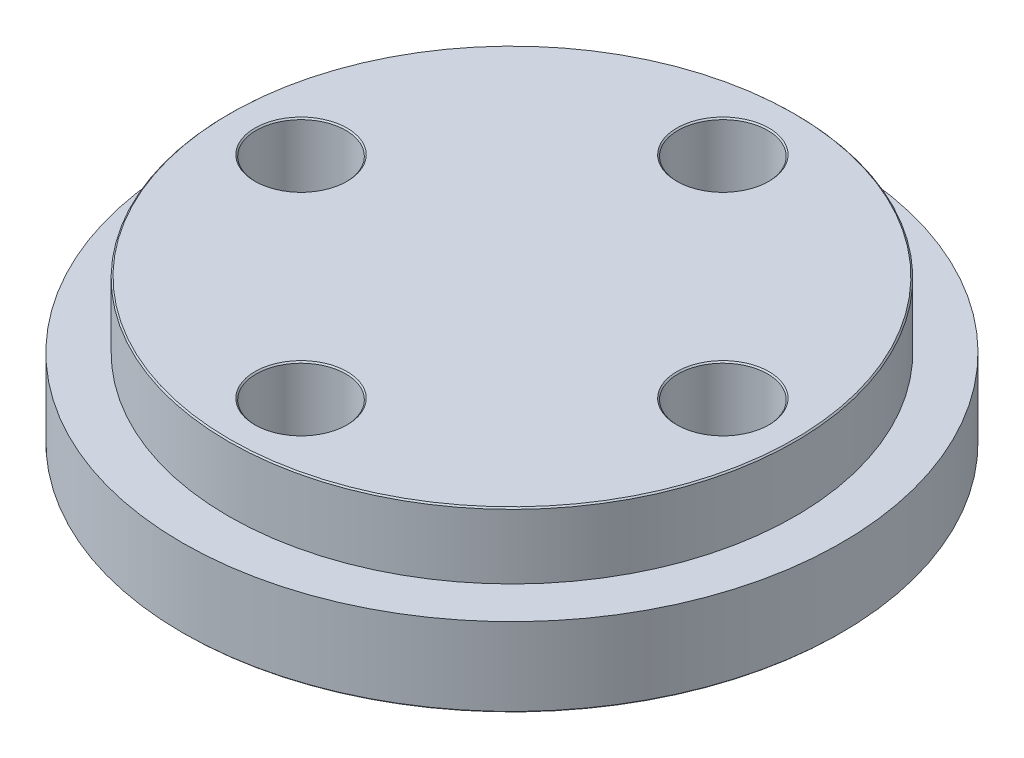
ISO-10303-21;
HEADER;
FILE_DESCRIPTION(('STEP AP214'),'2;1');
FILE_NAME('part.step','',(''),(''),'','','');
FILE_SCHEMA(('AUTOMOTIVE_DESIGN { 1 0 10303 214 1 1 1 1 }'));
ENDSEC;
DATA;
#1=APPLICATION_CONTEXT('core data for automotive mechanical design processes');
#2=APPLICATION_PROTOCOL_DEFINITION('international standard','automotive_design',2000,#1);
#3=PRODUCT_CONTEXT('',#1,'mechanical');
#4=PRODUCT('Part','Part','',(#3));
#5=PRODUCT_RELATED_PRODUCT_CATEGORY('part','',(#4));
#6=PRODUCT_DEFINITION_FORMATION('','',#4);
#7=PRODUCT_DEFINITION_CONTEXT('part definition',#1,'design');
#8=PRODUCT_DEFINITION('design','',#6,#7);
#9=PRODUCT_DEFINITION_SHAPE('','',#8);
#10=(LENGTH_UNIT() NAMED_UNIT(*) SI_UNIT(.MILLI.,.METRE.));
#11=(NAMED_UNIT(*) PLANE_ANGLE_UNIT() SI_UNIT($,.RADIAN.));
#12=(NAMED_UNIT(*) SI_UNIT($,.STERADIAN.) SOLID_ANGLE_UNIT());
#13=UNCERTAINTY_MEASURE_WITH_UNIT(LENGTH_MEASURE(1.E-05),#10,'distance_accuracy_value','');
#14=(GEOMETRIC_REPRESENTATION_CONTEXT(3) GLOBAL_UNCERTAINTY_ASSIGNED_CONTEXT((#13)) GLOBAL_UNIT_ASSIGNED_CONTEXT((#10,
#11,#12)) REPRESENTATION_CONTEXT('',''));
#15=CARTESIAN_POINT('',(0.,0.,0.));
#16=DIRECTION('',(0.,0.,1.));
#17=DIRECTION('',(1.,0.,0.));
#18=AXIS2_PLACEMENT_3D('',#15,#16,#17);
#19=CARTESIAN_POINT('',(0.,6.,0.));
#20=DIRECTION('',(0.,-1.,0.));
#21=DIRECTION('',(0.,0.,-1.));
#22=AXIS2_PLACEMENT_3D('',#19,#20,#21);
#23=CYLINDRICAL_SURFACE('',#22,25.);
#24=CARTESIAN_POINT('',(0.,0.0999999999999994,0.));
#25=DIRECTION('',(0.,1.,0.));
#26=DIRECTION('',(0.,0.,1.));
#27=AXIS2_PLACEMENT_3D('',#24,#25,#26);
#28=CIRCLE('',#27,25.);
#29=CARTESIAN_POINT('',(0.,0.0999999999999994,25.));
#30=VERTEX_POINT('',#29);
#31=EDGE_CURVE('E59',#30,#30,#28,.T.);
#32=ORIENTED_EDGE('',*,*,#31,.T.);
#33=EDGE_LOOP('',(#32));
#34=FACE_BOUND('',#33,.T.);
#35=CARTESIAN_POINT('',(0.,6.,0.));
#36=DIRECTION('',(0.,1.,0.));
#37=DIRECTION('',(0.,0.,1.));
#38=AXIS2_PLACEMENT_3D('',#35,#36,#37);
#39=CIRCLE('',#38,25.);
#40=CARTESIAN_POINT('',(0.,6.,25.));
#41=VERTEX_POINT('',#40);
#42=EDGE_CURVE('E104',#41,#41,#39,.T.);
#43=ORIENTED_EDGE('',*,*,#42,.F.);
#44=EDGE_LOOP('',(#43));
#45=FACE_BOUND('',#44,.T.);
#46=ADVANCED_FACE('F36',(#34,#45),#23,.T.);
#47=CARTESIAN_POINT('',(0.,6.,0.));
#48=DIRECTION('',(0.,1.,0.));
#49=DIRECTION('',(0.,0.,1.));
#50=AXIS2_PLACEMENT_3D('',#47,#48,#49);
#51=PLANE('',#50);
#52=CARTESIAN_POINT('',(0.,6.,0.));
#53=DIRECTION('',(0.,1.,0.));
#54=DIRECTION('',(0.,0.,1.));
#55=AXIS2_PLACEMENT_3D('',#52,#53,#54);
#56=CIRCLE('',#55,21.5);
#57=CARTESIAN_POINT('',(0.,6.,21.5));
#58=VERTEX_POINT('',#57);
#59=EDGE_CURVE('E107',#58,#58,#56,.T.);
#60=ORIENTED_EDGE('',*,*,#59,.F.);
#61=EDGE_LOOP('',(#60));
#62=FACE_BOUND('',#61,.T.);
#63=ORIENTED_EDGE('',*,*,#42,.T.);
#64=EDGE_LOOP('',(#63));
#65=FACE_BOUND('',#64,.T.);
#66=ADVANCED_FACE('F113',(#62,#65),#51,.T.);
#67=CARTESIAN_POINT('',(0.,0.,0.));
#68=DIRECTION('',(0.,1.,0.));
#69=DIRECTION('',(0.,0.,1.));
#70=AXIS2_PLACEMENT_3D('',#67,#68,#69);
#71=PLANE('',#70);
#72=CARTESIAN_POINT('',(0.,0.,0.));
#73=DIRECTION('',(0.,1.,0.));
#74=DIRECTION('',(0.,0.,1.));
#75=AXIS2_PLACEMENT_3D('',#72,#73,#74);
#76=CIRCLE('',#75,24.9);
#77=CARTESIAN_POINT('',(0.,0.,24.9));
#78=VERTEX_POINT('',#77);
#79=EDGE_CURVE('E10',#78,#78,#76,.F.);
#80=ORIENTED_EDGE('',*,*,#79,.T.);
#81=EDGE_LOOP('',(#80));
#82=FACE_BOUND('',#81,.T.);
#83=CARTESIAN_POINT('',(0.,0.,16.));
#84=DIRECTION('',(0.,1.,0.));
#85=DIRECTION('',(0.,0.,1.));
#86=AXIS2_PLACEMENT_3D('',#83,#84,#85);
#87=CIRCLE('',#86,3.49999999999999);
#88=CARTESIAN_POINT('',(0.,0.,19.5));
#89=VERTEX_POINT('',#88);
#90=EDGE_CURVE('E43',#89,#89,#87,.T.);
#91=ORIENTED_EDGE('',*,*,#90,.T.);
#92=EDGE_LOOP('',(#91));
#93=FACE_BOUND('',#92,.T.);
#94=CARTESIAN_POINT('',(-16.,0.,0.));
#95=DIRECTION('',(0.,1.,0.));
#96=DIRECTION('',(0.,0.,1.));
#97=AXIS2_PLACEMENT_3D('',#94,#95,#96);
#98=CIRCLE('',#97,3.49999999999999);
#99=CARTESIAN_POINT('',(-16.,0.,3.49999999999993));
#100=VERTEX_POINT('',#99);
#101=EDGE_CURVE('E47',#100,#100,#98,.T.);
#102=ORIENTED_EDGE('',*,*,#101,.T.);
#103=EDGE_LOOP('',(#102));
#104=FACE_BOUND('',#103,.T.);
#105=CARTESIAN_POINT('',(0.,0.,-16.));
#106=DIRECTION('',(0.,1.,0.));
#107=DIRECTION('',(0.,0.,1.));
#108=AXIS2_PLACEMENT_3D('',#105,#106,#107);
#109=CIRCLE('',#108,3.49999999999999);
#110=CARTESIAN_POINT('',(0.,0.,-12.5));
#111=VERTEX_POINT('',#110);
#112=EDGE_CURVE('E51',#111,#111,#109,.T.);
#113=ORIENTED_EDGE('',*,*,#112,.T.);
#114=EDGE_LOOP('',(#113));
#115=FACE_BOUND('',#114,.T.);
#116=CARTESIAN_POINT('',(16.,0.,1.6759110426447E-13));
#117=DIRECTION('',(0.,1.,0.));
#118=DIRECTION('',(0.,0.,1.));
#119=AXIS2_PLACEMENT_3D('',#116,#117,#118);
#120=CIRCLE('',#119,3.49999999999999);
#121=CARTESIAN_POINT('',(16.,0.,3.50000000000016));
#122=VERTEX_POINT('',#121);
#123=EDGE_CURVE('E56',#122,#122,#120,.T.);
#124=ORIENTED_EDGE('',*,*,#123,.T.);
#125=EDGE_LOOP('',(#124));
#126=FACE_BOUND('',#125,.T.);
#127=ADVANCED_FACE('F116',(#82,#93,#104,#115,#126),#71,.F.);
#128=CARTESIAN_POINT('',(0.,11.,0.));
#129=DIRECTION('',(0.,-1.,0.));
#130=DIRECTION('',(0.,0.,-1.));
#131=AXIS2_PLACEMENT_3D('',#128,#129,#130);
#132=CYLINDRICAL_SURFACE('',#131,21.5);
#133=CARTESIAN_POINT('',(0.,10.9,0.));
#134=DIRECTION('',(0.,1.,0.));
#135=DIRECTION('',(0.,0.,1.));
#136=AXIS2_PLACEMENT_3D('',#133,#134,#135);
#137=CIRCLE('',#136,21.5);
#138=CARTESIAN_POINT('',(0.,10.9,21.5));
#139=VERTEX_POINT('',#138);
#140=EDGE_CURVE('E86',#139,#139,#137,.F.);
#141=ORIENTED_EDGE('',*,*,#140,.T.);
#142=EDGE_LOOP('',(#141));
#143=FACE_BOUND('',#142,.T.);
#144=ORIENTED_EDGE('',*,*,#59,.T.);
#145=EDGE_LOOP('',(#144));
#146=FACE_BOUND('',#145,.T.);
#147=ADVANCED_FACE('F111',(#143,#146),#132,.T.);
#148=CARTESIAN_POINT('',(0.,11.,0.));
#149=DIRECTION('',(0.,1.,0.));
#150=DIRECTION('',(0.,0.,1.));
#151=AXIS2_PLACEMENT_3D('',#148,#149,#150);
#152=PLANE('',#151);
#153=CARTESIAN_POINT('',(0.,11.,0.));
#154=DIRECTION('',(0.,1.,0.));
#155=DIRECTION('',(0.,0.,1.));
#156=AXIS2_PLACEMENT_3D('',#153,#154,#155);
#157=CIRCLE('',#156,21.4);
#158=CARTESIAN_POINT('',(0.,11.,21.4));
#159=VERTEX_POINT('',#158);
#160=EDGE_CURVE('E89',#159,#159,#157,.T.);
#161=ORIENTED_EDGE('',*,*,#160,.T.);
#162=EDGE_LOOP('',(#161));
#163=FACE_BOUND('',#162,.T.);
#164=CARTESIAN_POINT('',(0.,11.,16.));
#165=DIRECTION('',(0.,1.,0.));
#166=DIRECTION('',(0.,0.,1.));
#167=AXIS2_PLACEMENT_3D('',#164,#165,#166);
#168=CIRCLE('',#167,3.5);
#169=CARTESIAN_POINT('',(0.,11.,19.5));
#170=VERTEX_POINT('',#169);
#171=EDGE_CURVE('E92',#170,#170,#168,.F.);
#172=ORIENTED_EDGE('',*,*,#171,.T.);
#173=EDGE_LOOP('',(#172));
#174=FACE_BOUND('',#173,.T.);
#175=CARTESIAN_POINT('',(-16.,11.,0.));
#176=DIRECTION('',(0.,1.,0.));
#177=DIRECTION('',(0.,0.,1.));
#178=AXIS2_PLACEMENT_3D('',#175,#176,#177);
#179=CIRCLE('',#178,3.5);
#180=CARTESIAN_POINT('',(-16.,11.,3.49999999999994));
#181=VERTEX_POINT('',#180);
#182=EDGE_CURVE('E95',#181,#181,#179,.F.);
#183=ORIENTED_EDGE('',*,*,#182,.T.);
#184=EDGE_LOOP('',(#183));
#185=FACE_BOUND('',#184,.T.);
#186=CARTESIAN_POINT('',(0.,11.,-16.));
#187=DIRECTION('',(0.,1.,0.));
#188=DIRECTION('',(0.,0.,1.));
#189=AXIS2_PLACEMENT_3D('',#186,#187,#188);
#190=CIRCLE('',#189,3.5);
#191=CARTESIAN_POINT('',(0.,11.,-12.5));
#192=VERTEX_POINT('',#191);
#193=EDGE_CURVE('E98',#192,#192,#190,.F.);
#194=ORIENTED_EDGE('',*,*,#193,.T.);
#195=EDGE_LOOP('',(#194));
#196=FACE_BOUND('',#195,.T.);
#197=CARTESIAN_POINT('',(16.,11.,1.6759110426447E-13));
#198=DIRECTION('',(0.,1.,0.));
#199=DIRECTION('',(0.,0.,1.));
#200=AXIS2_PLACEMENT_3D('',#197,#198,#199);
#201=CIRCLE('',#200,3.5);
#202=CARTESIAN_POINT('',(16.,11.,3.50000000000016));
#203=VERTEX_POINT('',#202);
#204=EDGE_CURVE('E101',#203,#203,#201,.F.);
#205=ORIENTED_EDGE('',*,*,#204,.T.);
#206=EDGE_LOOP('',(#205));
#207=FACE_BOUND('',#206,.T.);
#208=ADVANCED_FACE('F187',(#163,#174,#185,#196,#207),#152,.T.);
#209=CARTESIAN_POINT('',(0.,11.,16.));
#210=DIRECTION('',(0.,-1.,0.));
#211=DIRECTION('',(0.,0.,-1.));
#212=AXIS2_PLACEMENT_3D('',#209,#210,#211);
#213=CYLINDRICAL_SURFACE('',#212,3.4);
#214=CARTESIAN_POINT('',(0.,10.9,16.));
#215=DIRECTION('',(0.,1.,0.));
#216=DIRECTION('',(0.,0.,1.));
#217=AXIS2_PLACEMENT_3D('',#214,#215,#216);
#218=CIRCLE('',#217,3.4);
#219=CARTESIAN_POINT('',(0.,10.9,19.4));
#220=VERTEX_POINT('',#219);
#221=EDGE_CURVE('E80',#220,#220,#218,.T.);
#222=ORIENTED_EDGE('',*,*,#221,.T.);
#223=EDGE_LOOP('',(#222));
#224=FACE_BOUND('',#223,.T.);
#225=CARTESIAN_POINT('',(0.,0.0999999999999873,16.));
#226=DIRECTION('',(0.,1.,0.));
#227=DIRECTION('',(0.,0.,1.));
#228=AXIS2_PLACEMENT_3D('',#225,#226,#227);
#229=CIRCLE('',#228,3.4);
#230=CARTESIAN_POINT('',(0.,0.0999999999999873,19.4));
#231=VERTEX_POINT('',#230);
#232=EDGE_CURVE('E83',#231,#231,#229,.F.);
#233=ORIENTED_EDGE('',*,*,#232,.T.);
#234=EDGE_LOOP('',(#233));
#235=FACE_BOUND('',#234,.T.);
#236=ADVANCED_FACE('F182',(#224,#235),#213,.F.);
#237=CARTESIAN_POINT('',(-16.,11.,0.));
#238=DIRECTION('',(0.,-1.,0.));
#239=DIRECTION('',(0.,0.,-1.));
#240=AXIS2_PLACEMENT_3D('',#237,#238,#239);
#241=CYLINDRICAL_SURFACE('',#240,3.4);
#242=CARTESIAN_POINT('',(-16.,10.9,0.));
#243=DIRECTION('',(0.,1.,0.));
#244=DIRECTION('',(0.,0.,1.));
#245=AXIS2_PLACEMENT_3D('',#242,#243,#244);
#246=CIRCLE('',#245,3.4);
#247=CARTESIAN_POINT('',(-16.,10.9,3.39999999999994));
#248=VERTEX_POINT('',#247);
#249=EDGE_CURVE('E74',#248,#248,#246,.T.);
#250=ORIENTED_EDGE('',*,*,#249,.T.);
#251=EDGE_LOOP('',(#250));
#252=FACE_BOUND('',#251,.T.);
#253=CARTESIAN_POINT('',(-16.,0.0999999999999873,0.));
#254=DIRECTION('',(0.,1.,0.));
#255=DIRECTION('',(0.,0.,1.));
#256=AXIS2_PLACEMENT_3D('',#253,#254,#255);
#257=CIRCLE('',#256,3.4);
#258=CARTESIAN_POINT('',(-16.,0.0999999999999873,3.39999999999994));
#259=VERTEX_POINT('',#258);
#260=EDGE_CURVE('E77',#259,#259,#257,.F.);
#261=ORIENTED_EDGE('',*,*,#260,.T.);
#262=EDGE_LOOP('',(#261));
#263=FACE_BOUND('',#262,.T.);
#264=ADVANCED_FACE('F172',(#252,#263),#241,.F.);
#265=CARTESIAN_POINT('',(0.,11.,-16.));
#266=DIRECTION('',(0.,-1.,0.));
#267=DIRECTION('',(0.,0.,-1.));
#268=AXIS2_PLACEMENT_3D('',#265,#266,#267);
#269=CYLINDRICAL_SURFACE('',#268,3.4);
#270=CARTESIAN_POINT('',(0.,10.9,-16.));
#271=DIRECTION('',(0.,1.,0.));
#272=DIRECTION('',(0.,0.,1.));
#273=AXIS2_PLACEMENT_3D('',#270,#271,#272);
#274=CIRCLE('',#273,3.4);
#275=CARTESIAN_POINT('',(0.,10.9,-12.6));
#276=VERTEX_POINT('',#275);
#277=EDGE_CURVE('E68',#276,#276,#274,.T.);
#278=ORIENTED_EDGE('',*,*,#277,.T.);
#279=EDGE_LOOP('',(#278));
#280=FACE_BOUND('',#279,.T.);
#281=CARTESIAN_POINT('',(0.,0.0999999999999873,-16.));
#282=DIRECTION('',(0.,1.,0.));
#283=DIRECTION('',(0.,0.,1.));
#284=AXIS2_PLACEMENT_3D('',#281,#282,#283);
#285=CIRCLE('',#284,3.4);
#286=CARTESIAN_POINT('',(0.,0.0999999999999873,-12.6));
#287=VERTEX_POINT('',#286);
#288=EDGE_CURVE('E71',#287,#287,#285,.F.);
#289=ORIENTED_EDGE('',*,*,#288,.T.);
#290=EDGE_LOOP('',(#289));
#291=FACE_BOUND('',#290,.T.);
#292=ADVANCED_FACE('F170',(#280,#291),#269,.F.);
#293=CARTESIAN_POINT('',(16.,11.,1.6759110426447E-13));
#294=DIRECTION('',(0.,-1.,0.));
#295=DIRECTION('',(0.,0.,-1.));
#296=AXIS2_PLACEMENT_3D('',#293,#294,#295);
#297=CYLINDRICAL_SURFACE('',#296,3.4);
#298=CARTESIAN_POINT('',(16.,10.9,1.6759110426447E-13));
#299=DIRECTION('',(0.,1.,0.));
#300=DIRECTION('',(0.,0.,1.));
#301=AXIS2_PLACEMENT_3D('',#298,#299,#300);
#302=CIRCLE('',#301,3.4);
#303=CARTESIAN_POINT('',(16.,10.9,3.40000000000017));
#304=VERTEX_POINT('',#303);
#305=EDGE_CURVE('E62',#304,#304,#302,.T.);
#306=ORIENTED_EDGE('',*,*,#305,.T.);
#307=EDGE_LOOP('',(#306));
#308=FACE_BOUND('',#307,.T.);
#309=CARTESIAN_POINT('',(16.,0.0999999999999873,1.6759110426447E-13));
#310=DIRECTION('',(0.,1.,0.));
#311=DIRECTION('',(0.,0.,1.));
#312=AXIS2_PLACEMENT_3D('',#309,#310,#311);
#313=CIRCLE('',#312,3.4);
#314=CARTESIAN_POINT('',(16.,0.0999999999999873,3.40000000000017));
#315=VERTEX_POINT('',#314);
#316=EDGE_CURVE('E65',#315,#315,#313,.F.);
#317=ORIENTED_EDGE('',*,*,#316,.T.);
#318=EDGE_LOOP('',(#317));
#319=FACE_BOUND('',#318,.T.);
#320=ADVANCED_FACE('F131',(#308,#319),#297,.F.);
#321=CARTESIAN_POINT('',(0.,11.,0.));
#322=DIRECTION('',(0.,-1.,0.));
#323=DIRECTION('',(0.,0.,-1.));
#324=AXIS2_PLACEMENT_3D('',#321,#322,#323);
#325=CONICAL_SURFACE('',#324,21.4,0.785398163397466);
#326=ORIENTED_EDGE('',*,*,#140,.F.);
#327=EDGE_LOOP('',(#326));
#328=FACE_BOUND('',#327,.T.);
#329=ORIENTED_EDGE('',*,*,#160,.F.);
#330=EDGE_LOOP('',(#329));
#331=FACE_BOUND('',#330,.T.);
#332=ADVANCED_FACE('F127',(#328,#331),#325,.T.);
#333=CARTESIAN_POINT('',(0.,11.,16.));
#334=DIRECTION('',(0.,1.,0.));
#335=DIRECTION('',(0.,0.,1.));
#336=AXIS2_PLACEMENT_3D('',#333,#334,#335);
#337=CONICAL_SURFACE('',#336,3.5,0.785398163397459);
#338=CARTESIAN_POINT('',(0.,10.9,19.4));
#339=CARTESIAN_POINT('',(0.,10.9010416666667,19.4010416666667));
#340=CARTESIAN_POINT('',(0.,10.9020833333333,19.4020833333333));
#341=CARTESIAN_POINT('',(0.,10.9041666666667,19.4041666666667));
#342=CARTESIAN_POINT('',(0.,10.9052083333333,19.4052083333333));
#343=CARTESIAN_POINT('',(0.,10.9072916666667,19.4072916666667));
#344=CARTESIAN_POINT('',(0.,10.9083333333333,19.4083333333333));
#345=CARTESIAN_POINT('',(0.,10.9104166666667,19.4104166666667));
#346=CARTESIAN_POINT('',(0.,10.9114583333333,19.4114583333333));
#347=CARTESIAN_POINT('',(0.,10.9135416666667,19.4135416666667));
#348=CARTESIAN_POINT('',(0.,10.9145833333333,19.4145833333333));
#349=CARTESIAN_POINT('',(0.,10.9166666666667,19.4166666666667));
#350=CARTESIAN_POINT('',(0.,10.9177083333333,19.4177083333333));
#351=CARTESIAN_POINT('',(0.,10.9197916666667,19.4197916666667));
#352=CARTESIAN_POINT('',(0.,10.9208333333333,19.4208333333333));
#353=CARTESIAN_POINT('',(0.,10.9229166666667,19.4229166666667));
#354=CARTESIAN_POINT('',(0.,10.9239583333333,19.4239583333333));
#355=CARTESIAN_POINT('',(0.,10.9260416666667,19.4260416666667));
#356=CARTESIAN_POINT('',(0.,10.9270833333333,19.4270833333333));
#357=CARTESIAN_POINT('',(0.,10.9291666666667,19.4291666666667));
#358=CARTESIAN_POINT('',(0.,10.9302083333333,19.4302083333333));
#359=CARTESIAN_POINT('',(0.,10.9322916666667,19.4322916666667));
#360=CARTESIAN_POINT('',(0.,10.9333333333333,19.4333333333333));
#361=CARTESIAN_POINT('',(0.,10.9354166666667,19.4354166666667));
#362=CARTESIAN_POINT('',(0.,10.9364583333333,19.4364583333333));
#363=CARTESIAN_POINT('',(0.,10.9385416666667,19.4385416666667));
#364=CARTESIAN_POINT('',(0.,10.9395833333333,19.4395833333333));
#365=CARTESIAN_POINT('',(0.,10.9416666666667,19.4416666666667));
#366=CARTESIAN_POINT('',(0.,10.9427083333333,19.4427083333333));
#367=CARTESIAN_POINT('',(0.,10.9447916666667,19.4447916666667));
#368=CARTESIAN_POINT('',(0.,10.9458333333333,19.4458333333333));
#369=CARTESIAN_POINT('',(0.,10.9479166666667,19.4479166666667));
#370=CARTESIAN_POINT('',(0.,10.9489583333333,19.4489583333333));
#371=CARTESIAN_POINT('',(0.,10.9510416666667,19.4510416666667));
#372=CARTESIAN_POINT('',(0.,10.9520833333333,19.4520833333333));
#373=CARTESIAN_POINT('',(0.,10.9541666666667,19.4541666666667));
#374=CARTESIAN_POINT('',(0.,10.9552083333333,19.4552083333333));
#375=CARTESIAN_POINT('',(0.,10.9572916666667,19.4572916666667));
#376=CARTESIAN_POINT('',(0.,10.9583333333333,19.4583333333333));
#377=CARTESIAN_POINT('',(0.,10.9604166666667,19.4604166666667));
#378=CARTESIAN_POINT('',(0.,10.9614583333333,19.4614583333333));
#379=CARTESIAN_POINT('',(0.,10.9635416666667,19.4635416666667));
#380=CARTESIAN_POINT('',(0.,10.9645833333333,19.4645833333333));
#381=CARTESIAN_POINT('',(0.,10.9666666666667,19.4666666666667));
#382=CARTESIAN_POINT('',(0.,10.9677083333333,19.4677083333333));
#383=CARTESIAN_POINT('',(0.,10.9697916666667,19.4697916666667));
#384=CARTESIAN_POINT('',(0.,10.9708333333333,19.4708333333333));
#385=CARTESIAN_POINT('',(0.,10.9729166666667,19.4729166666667));
#386=CARTESIAN_POINT('',(0.,10.9739583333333,19.4739583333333));
#387=CARTESIAN_POINT('',(0.,10.9760416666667,19.4760416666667));
#388=CARTESIAN_POINT('',(0.,10.9770833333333,19.4770833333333));
#389=CARTESIAN_POINT('',(0.,10.9791666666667,19.4791666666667));
#390=CARTESIAN_POINT('',(0.,10.9802083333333,19.4802083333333));
#391=CARTESIAN_POINT('',(0.,10.9822916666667,19.4822916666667));
#392=CARTESIAN_POINT('',(0.,10.9833333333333,19.4833333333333));
#393=CARTESIAN_POINT('',(0.,10.9854166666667,19.4854166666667));
#394=CARTESIAN_POINT('',(0.,10.9864583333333,19.4864583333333));
#395=CARTESIAN_POINT('',(0.,10.9885416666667,19.4885416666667));
#396=CARTESIAN_POINT('',(0.,10.9895833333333,19.4895833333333));
#397=CARTESIAN_POINT('',(0.,10.9916666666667,19.4916666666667));
#398=CARTESIAN_POINT('',(0.,10.9927083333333,19.4927083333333));
#399=CARTESIAN_POINT('',(0.,10.9947916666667,19.4947916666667));
#400=CARTESIAN_POINT('',(0.,10.9958333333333,19.4958333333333));
#401=CARTESIAN_POINT('',(0.,10.9979166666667,19.4979166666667));
#402=CARTESIAN_POINT('',(0.,10.9989583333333,19.4989583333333));
#403=CARTESIAN_POINT('',(0.,11.,19.5));
#404=B_SPLINE_CURVE_WITH_KNOTS('',3,(#338,#339,#340,#341,#342,#343,#344,#345,#346,#347,#348,
#349,#350,#351,#352,#353,#354,#355,#356,#357,#358,#359,#360,#361,#362,#363,#364,#365,#366,#367,
#368,#369,#370,#371,#372,#373,#374,#375,#376,#377,#378,#379,#380,#381,#382,#383,#384,#385,#386,
#387,#388,#389,#390,#391,#392,#393,#394,#395,#396,#397,#398,#399,#400,#401,#402,#403),
.UNSPECIFIED.,.F.,.F.,(4,2,2,2,2,2,2,2,2,2,2,2,2,2,2,2,2,2,2,2,2,2,2,2,2,2,2,2,2,2,2,2,4),(0.,
0.00441941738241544,0.00883883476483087,0.0132582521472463,0.0176776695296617,
0.0220970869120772,0.0265165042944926,0.030935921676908,0.0353553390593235,0.0397747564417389,
0.0441941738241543,0.048613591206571,0.0530330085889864,0.0574524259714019,0.0618718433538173,
0.0662912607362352,0.0707106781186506,0.0751300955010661,0.0795495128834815,0.083968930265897,
0.0883883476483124,0.0928077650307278,0.0972271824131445,0.10164659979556,0.106066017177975,
0.110485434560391,0.114904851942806,0.119324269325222,0.12374368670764,0.128163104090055,
0.13258252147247,0.137001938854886,0.141421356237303),.UNSPECIFIED.);
#405=EDGE_CURVE('BSEAM130',#220,#170,#404,.T.);
#406=ORIENTED_EDGE('',*,*,#221,.F.);
#407=ORIENTED_EDGE('',*,*,#171,.F.);
#408=ORIENTED_EDGE('',*,*,#405,.T.);
#409=ORIENTED_EDGE('',*,*,#405,.F.);
#410=EDGE_LOOP('',(#406,#408,#407,#409));
#411=FACE_BOUND('',#410,.T.);
#412=ADVANCED_FACE('F130',(#411),#337,.F.);
#413=CARTESIAN_POINT('',(-16.,11.,0.));
#414=DIRECTION('',(0.,1.,0.));
#415=DIRECTION('',(0.,0.,1.));
#416=AXIS2_PLACEMENT_3D('',#413,#414,#415);
#417=CONICAL_SURFACE('',#416,3.5,0.785398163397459);
#418=CARTESIAN_POINT('',(-16.,10.9,3.39999999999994));
#419=CARTESIAN_POINT('',(-16.,10.9010416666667,3.40104166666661));
#420=CARTESIAN_POINT('',(-16.,10.9020833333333,3.40208333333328));
#421=CARTESIAN_POINT('',(-16.,10.9041666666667,3.40416666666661));
#422=CARTESIAN_POINT('',(-16.,10.9052083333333,3.40520833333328));
#423=CARTESIAN_POINT('',(-16.,10.9072916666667,3.40729166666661));
#424=CARTESIAN_POINT('',(-16.,10.9083333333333,3.40833333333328));
#425=CARTESIAN_POINT('',(-16.,10.9104166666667,3.41041666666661));
#426=CARTESIAN_POINT('',(-16.,10.9114583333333,3.41145833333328));
#427=CARTESIAN_POINT('',(-16.,10.9135416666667,3.41354166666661));
#428=CARTESIAN_POINT('',(-16.,10.9145833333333,3.41458333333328));
#429=CARTESIAN_POINT('',(-16.,10.9166666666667,3.41666666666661));
#430=CARTESIAN_POINT('',(-16.,10.9177083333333,3.41770833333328));
#431=CARTESIAN_POINT('',(-16.,10.9197916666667,3.41979166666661));
#432=CARTESIAN_POINT('',(-16.,10.9208333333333,3.42083333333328));
#433=CARTESIAN_POINT('',(-16.,10.9229166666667,3.42291666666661));
#434=CARTESIAN_POINT('',(-16.,10.9239583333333,3.42395833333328));
#435=CARTESIAN_POINT('',(-16.,10.9260416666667,3.42604166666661));
#436=CARTESIAN_POINT('',(-16.,10.9270833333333,3.42708333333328));
#437=CARTESIAN_POINT('',(-16.,10.9291666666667,3.42916666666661));
#438=CARTESIAN_POINT('',(-16.,10.9302083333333,3.43020833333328));
#439=CARTESIAN_POINT('',(-16.,10.9322916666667,3.43229166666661));
#440=CARTESIAN_POINT('',(-16.,10.9333333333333,3.43333333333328));
#441=CARTESIAN_POINT('',(-16.,10.9354166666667,3.43541666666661));
#442=CARTESIAN_POINT('',(-16.,10.9364583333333,3.43645833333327));
#443=CARTESIAN_POINT('',(-16.,10.9385416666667,3.43854166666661));
#444=CARTESIAN_POINT('',(-16.,10.9395833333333,3.43958333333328));
#445=CARTESIAN_POINT('',(-16.,10.9416666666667,3.44166666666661));
#446=CARTESIAN_POINT('',(-16.,10.9427083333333,3.44270833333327));
#447=CARTESIAN_POINT('',(-16.,10.9447916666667,3.44479166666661));
#448=CARTESIAN_POINT('',(-16.,10.9458333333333,3.44583333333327));
#449=CARTESIAN_POINT('',(-16.,10.9479166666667,3.44791666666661));
#450=CARTESIAN_POINT('',(-16.,10.9489583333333,3.44895833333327));
#451=CARTESIAN_POINT('',(-16.,10.9510416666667,3.45104166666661));
#452=CARTESIAN_POINT('',(-16.,10.9520833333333,3.45208333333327));
#453=CARTESIAN_POINT('',(-16.,10.9541666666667,3.45416666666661));
#454=CARTESIAN_POINT('',(-16.,10.9552083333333,3.45520833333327));
#455=CARTESIAN_POINT('',(-16.,10.9572916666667,3.45729166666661));
#456=CARTESIAN_POINT('',(-16.,10.9583333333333,3.45833333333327));
#457=CARTESIAN_POINT('',(-16.,10.9604166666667,3.46041666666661));
#458=CARTESIAN_POINT('',(-16.,10.9614583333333,3.46145833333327));
#459=CARTESIAN_POINT('',(-16.,10.9635416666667,3.46354166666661));
#460=CARTESIAN_POINT('',(-16.,10.9645833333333,3.46458333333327));
#461=CARTESIAN_POINT('',(-16.,10.9666666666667,3.46666666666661));
#462=CARTESIAN_POINT('',(-16.,10.9677083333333,3.46770833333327));
#463=CARTESIAN_POINT('',(-16.,10.9697916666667,3.46979166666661));
#464=CARTESIAN_POINT('',(-16.,10.9708333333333,3.47083333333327));
#465=CARTESIAN_POINT('',(-16.,10.9729166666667,3.47291666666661));
#466=CARTESIAN_POINT('',(-16.,10.9739583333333,3.47395833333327));
#467=CARTESIAN_POINT('',(-16.,10.9760416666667,3.47604166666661));
#468=CARTESIAN_POINT('',(-16.,10.9770833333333,3.47708333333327));
#469=CARTESIAN_POINT('',(-16.,10.9791666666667,3.47916666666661));
#470=CARTESIAN_POINT('',(-16.,10.9802083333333,3.48020833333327));
#471=CARTESIAN_POINT('',(-16.,10.9822916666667,3.48229166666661));
#472=CARTESIAN_POINT('',(-16.,10.9833333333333,3.48333333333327));
#473=CARTESIAN_POINT('',(-16.,10.9854166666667,3.48541666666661));
#474=CARTESIAN_POINT('',(-16.,10.9864583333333,3.48645833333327));
#475=CARTESIAN_POINT('',(-16.,10.9885416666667,3.48854166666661));
#476=CARTESIAN_POINT('',(-16.,10.9895833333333,3.48958333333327));
#477=CARTESIAN_POINT('',(-16.,10.9916666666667,3.49166666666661));
#478=CARTESIAN_POINT('',(-16.,10.9927083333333,3.49270833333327));
#479=CARTESIAN_POINT('',(-16.,10.9947916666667,3.49479166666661));
#480=CARTESIAN_POINT('',(-16.,10.9958333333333,3.49583333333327));
#481=CARTESIAN_POINT('',(-16.,10.9979166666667,3.49791666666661));
#482=CARTESIAN_POINT('',(-16.,10.9989583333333,3.49895833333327));
#483=CARTESIAN_POINT('',(-16.,11.,3.49999999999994));
#484=B_SPLINE_CURVE_WITH_KNOTS('',3,(#418,#419,#420,#421,#422,#423,#424,#425,#426,#427,#428,
#429,#430,#431,#432,#433,#434,#435,#436,#437,#438,#439,#440,#441,#442,#443,#444,#445,#446,#447,
#448,#449,#450,#451,#452,#453,#454,#455,#456,#457,#458,#459,#460,#461,#462,#463,#464,#465,#466,
#467,#468,#469,#470,#471,#472,#473,#474,#475,#476,#477,#478,#479,#480,#481,#482,#483),
.UNSPECIFIED.,.F.,.F.,(4,2,2,2,2,2,2,2,2,2,2,2,2,2,2,2,2,2,2,2,2,2,2,2,2,2,2,2,2,2,2,2,4),(0.,
0.00441941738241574,0.00883883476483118,0.0132582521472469,0.0176776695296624,
0.0220970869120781,0.0265165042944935,0.0309359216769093,0.0353553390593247,0.0397747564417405,
0.0441941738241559,0.0486135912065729,0.0530330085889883,0.057452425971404,0.0618718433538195,
0.0662912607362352,0.0707106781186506,0.0751300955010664,0.0795495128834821,0.0839689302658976,
0.0883883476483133,0.0928077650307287,0.0972271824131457,0.101646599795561,0.106066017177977,
0.110485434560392,0.114904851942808,0.119324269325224,0.123743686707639,0.128163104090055,
0.13258252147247,0.137001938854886,0.141421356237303),.UNSPECIFIED.);
#485=EDGE_CURVE('BSEAM135',#248,#181,#484,.T.);
#486=ORIENTED_EDGE('',*,*,#249,.F.);
#487=ORIENTED_EDGE('',*,*,#182,.F.);
#488=ORIENTED_EDGE('',*,*,#485,.T.);
#489=ORIENTED_EDGE('',*,*,#485,.F.);
#490=EDGE_LOOP('',(#486,#488,#487,#489));
#491=FACE_BOUND('',#490,.T.);
#492=ADVANCED_FACE('F135',(#491),#417,.F.);
#493=CARTESIAN_POINT('',(0.,11.,-16.));
#494=DIRECTION('',(0.,1.,0.));
#495=DIRECTION('',(0.,0.,1.));
#496=AXIS2_PLACEMENT_3D('',#493,#494,#495);
#497=CONICAL_SURFACE('',#496,3.5,0.785398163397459);
#498=CARTESIAN_POINT('',(0.,10.9,-12.6));
#499=CARTESIAN_POINT('',(0.,10.9010416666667,-12.5989583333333));
#500=CARTESIAN_POINT('',(0.,10.9020833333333,-12.5979166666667));
#501=CARTESIAN_POINT('',(0.,10.9041666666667,-12.5958333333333));
#502=CARTESIAN_POINT('',(0.,10.9052083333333,-12.5947916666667));
#503=CARTESIAN_POINT('',(0.,10.9072916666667,-12.5927083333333));
#504=CARTESIAN_POINT('',(0.,10.9083333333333,-12.5916666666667));
#505=CARTESIAN_POINT('',(0.,10.9104166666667,-12.5895833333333));
#506=CARTESIAN_POINT('',(0.,10.9114583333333,-12.5885416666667));
#507=CARTESIAN_POINT('',(0.,10.9135416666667,-12.5864583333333));
#508=CARTESIAN_POINT('',(0.,10.9145833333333,-12.5854166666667));
#509=CARTESIAN_POINT('',(0.,10.9166666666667,-12.5833333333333));
#510=CARTESIAN_POINT('',(0.,10.9177083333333,-12.5822916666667));
#511=CARTESIAN_POINT('',(0.,10.9197916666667,-12.5802083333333));
#512=CARTESIAN_POINT('',(0.,10.9208333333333,-12.5791666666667));
#513=CARTESIAN_POINT('',(0.,10.9229166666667,-12.5770833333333));
#514=CARTESIAN_POINT('',(0.,10.9239583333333,-12.5760416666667));
#515=CARTESIAN_POINT('',(0.,10.9260416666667,-12.5739583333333));
#516=CARTESIAN_POINT('',(0.,10.9270833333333,-12.5729166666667));
#517=CARTESIAN_POINT('',(0.,10.9291666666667,-12.5708333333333));
#518=CARTESIAN_POINT('',(0.,10.9302083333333,-12.5697916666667));
#519=CARTESIAN_POINT('',(0.,10.9322916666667,-12.5677083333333));
#520=CARTESIAN_POINT('',(0.,10.9333333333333,-12.5666666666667));
#521=CARTESIAN_POINT('',(0.,10.9354166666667,-12.5645833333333));
#522=CARTESIAN_POINT('',(0.,10.9364583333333,-12.5635416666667));
#523=CARTESIAN_POINT('',(0.,10.9385416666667,-12.5614583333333));
#524=CARTESIAN_POINT('',(0.,10.9395833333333,-12.5604166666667));
#525=CARTESIAN_POINT('',(0.,10.9416666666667,-12.5583333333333));
#526=CARTESIAN_POINT('',(0.,10.9427083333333,-12.5572916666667));
#527=CARTESIAN_POINT('',(0.,10.9447916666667,-12.5552083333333));
#528=CARTESIAN_POINT('',(0.,10.9458333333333,-12.5541666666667));
#529=CARTESIAN_POINT('',(0.,10.9479166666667,-12.5520833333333));
#530=CARTESIAN_POINT('',(0.,10.9489583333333,-12.5510416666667));
#531=CARTESIAN_POINT('',(0.,10.9510416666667,-12.5489583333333));
#532=CARTESIAN_POINT('',(0.,10.9520833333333,-12.5479166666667));
#533=CARTESIAN_POINT('',(0.,10.9541666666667,-12.5458333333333));
#534=CARTESIAN_POINT('',(0.,10.9552083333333,-12.5447916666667));
#535=CARTESIAN_POINT('',(0.,10.9572916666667,-12.5427083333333));
#536=CARTESIAN_POINT('',(0.,10.9583333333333,-12.5416666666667));
#537=CARTESIAN_POINT('',(0.,10.9604166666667,-12.5395833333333));
#538=CARTESIAN_POINT('',(0.,10.9614583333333,-12.5385416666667));
#539=CARTESIAN_POINT('',(0.,10.9635416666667,-12.5364583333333));
#540=CARTESIAN_POINT('',(0.,10.9645833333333,-12.5354166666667));
#541=CARTESIAN_POINT('',(0.,10.9666666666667,-12.5333333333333));
#542=CARTESIAN_POINT('',(0.,10.9677083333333,-12.5322916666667));
#543=CARTESIAN_POINT('',(0.,10.9697916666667,-12.5302083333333));
#544=CARTESIAN_POINT('',(0.,10.9708333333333,-12.5291666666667));
#545=CARTESIAN_POINT('',(0.,10.9729166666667,-12.5270833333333));
#546=CARTESIAN_POINT('',(0.,10.9739583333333,-12.5260416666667));
#547=CARTESIAN_POINT('',(0.,10.9760416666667,-12.5239583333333));
#548=CARTESIAN_POINT('',(0.,10.9770833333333,-12.5229166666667));
#549=CARTESIAN_POINT('',(0.,10.9791666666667,-12.5208333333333));
#550=CARTESIAN_POINT('',(0.,10.9802083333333,-12.5197916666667));
#551=CARTESIAN_POINT('',(0.,10.9822916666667,-12.5177083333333));
#552=CARTESIAN_POINT('',(0.,10.9833333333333,-12.5166666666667));
#553=CARTESIAN_POINT('',(0.,10.9854166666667,-12.5145833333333));
#554=CARTESIAN_POINT('',(0.,10.9864583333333,-12.5135416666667));
#555=CARTESIAN_POINT('',(0.,10.9885416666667,-12.5114583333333));
#556=CARTESIAN_POINT('',(0.,10.9895833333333,-12.5104166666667));
#557=CARTESIAN_POINT('',(0.,10.9916666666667,-12.5083333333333));
#558=CARTESIAN_POINT('',(0.,10.9927083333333,-12.5072916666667));
#559=CARTESIAN_POINT('',(0.,10.9947916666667,-12.5052083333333));
#560=CARTESIAN_POINT('',(0.,10.9958333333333,-12.5041666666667));
#561=CARTESIAN_POINT('',(0.,10.9979166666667,-12.5020833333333));
#562=CARTESIAN_POINT('',(0.,10.9989583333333,-12.5010416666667));
#563=CARTESIAN_POINT('',(0.,11.,-12.5));
#564=B_SPLINE_CURVE_WITH_KNOTS('',3,(#498,#499,#500,#501,#502,#503,#504,#505,#506,#507,#508,
#509,#510,#511,#512,#513,#514,#515,#516,#517,#518,#519,#520,#521,#522,#523,#524,#525,#526,#527,
#528,#529,#530,#531,#532,#533,#534,#535,#536,#537,#538,#539,#540,#541,#542,#543,#544,#545,#546,
#547,#548,#549,#550,#551,#552,#553,#554,#555,#556,#557,#558,#559,#560,#561,#562,#563),
.UNSPECIFIED.,.F.,.F.,(4,2,2,2,2,2,2,2,2,2,2,2,2,2,2,2,2,2,2,2,2,2,2,2,2,2,2,2,2,2,2,2,4),(0.,
0.00441941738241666,0.0088388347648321,0.0132582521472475,0.017677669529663,0.0220970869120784,
0.0265165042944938,0.0309359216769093,0.0353553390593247,0.0397747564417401,0.0441941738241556,
0.0486135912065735,0.0530330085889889,0.0574524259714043,0.0618718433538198,0.0662912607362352,
0.0707106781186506,0.0751300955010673,0.0795495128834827,0.0839689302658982,0.0883883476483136,
0.0928077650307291,0.0972271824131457,0.101646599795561,0.106066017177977,0.110485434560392,
0.114904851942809,0.119324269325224,0.12374368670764,0.128163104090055,0.13258252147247,
0.137001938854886,0.141421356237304),.UNSPECIFIED.);
#565=EDGE_CURVE('BSEAM139',#276,#192,#564,.T.);
#566=ORIENTED_EDGE('',*,*,#277,.F.);
#567=ORIENTED_EDGE('',*,*,#193,.F.);
#568=ORIENTED_EDGE('',*,*,#565,.T.);
#569=ORIENTED_EDGE('',*,*,#565,.F.);
#570=EDGE_LOOP('',(#566,#568,#567,#569));
#571=FACE_BOUND('',#570,.T.);
#572=ADVANCED_FACE('F139',(#571),#497,.F.);
#573=CARTESIAN_POINT('',(16.,11.,1.6759110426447E-13));
#574=DIRECTION('',(0.,1.,0.));
#575=DIRECTION('',(0.,0.,1.));
#576=AXIS2_PLACEMENT_3D('',#573,#574,#575);
#577=CONICAL_SURFACE('',#576,3.5,0.785398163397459);
#578=CARTESIAN_POINT('',(16.,10.9,3.40000000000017));
#579=CARTESIAN_POINT('',(16.,10.9010416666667,3.40104166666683));
#580=CARTESIAN_POINT('',(16.,10.9020833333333,3.4020833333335));
#581=CARTESIAN_POINT('',(16.,10.9041666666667,3.40416666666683));
#582=CARTESIAN_POINT('',(16.,10.9052083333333,3.4052083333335));
#583=CARTESIAN_POINT('',(16.,10.9072916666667,3.40729166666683));
#584=CARTESIAN_POINT('',(16.,10.9083333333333,3.4083333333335));
#585=CARTESIAN_POINT('',(16.,10.9104166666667,3.41041666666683));
#586=CARTESIAN_POINT('',(16.,10.9114583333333,3.4114583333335));
#587=CARTESIAN_POINT('',(16.,10.9135416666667,3.41354166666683));
#588=CARTESIAN_POINT('',(16.,10.9145833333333,3.4145833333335));
#589=CARTESIAN_POINT('',(16.,10.9166666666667,3.41666666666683));
#590=CARTESIAN_POINT('',(16.,10.9177083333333,3.4177083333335));
#591=CARTESIAN_POINT('',(16.,10.9197916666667,3.41979166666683));
#592=CARTESIAN_POINT('',(16.,10.9208333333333,3.4208333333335));
#593=CARTESIAN_POINT('',(16.,10.9229166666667,3.42291666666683));
#594=CARTESIAN_POINT('',(16.,10.9239583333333,3.4239583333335));
#595=CARTESIAN_POINT('',(16.,10.9260416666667,3.42604166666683));
#596=CARTESIAN_POINT('',(16.,10.9270833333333,3.4270833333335));
#597=CARTESIAN_POINT('',(16.,10.9291666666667,3.42916666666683));
#598=CARTESIAN_POINT('',(16.,10.9302083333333,3.4302083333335));
#599=CARTESIAN_POINT('',(16.,10.9322916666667,3.43229166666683));
#600=CARTESIAN_POINT('',(16.,10.9333333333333,3.4333333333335));
#601=CARTESIAN_POINT('',(16.,10.9354166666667,3.43541666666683));
#602=CARTESIAN_POINT('',(16.,10.9364583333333,3.4364583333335));
#603=CARTESIAN_POINT('',(16.,10.9385416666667,3.43854166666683));
#604=CARTESIAN_POINT('',(16.,10.9395833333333,3.4395833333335));
#605=CARTESIAN_POINT('',(16.,10.9416666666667,3.44166666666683));
#606=CARTESIAN_POINT('',(16.,10.9427083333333,3.4427083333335));
#607=CARTESIAN_POINT('',(16.,10.9447916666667,3.44479166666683));
#608=CARTESIAN_POINT('',(16.,10.9458333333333,3.4458333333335));
#609=CARTESIAN_POINT('',(16.,10.9479166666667,3.44791666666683));
#610=CARTESIAN_POINT('',(16.,10.9489583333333,3.4489583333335));
#611=CARTESIAN_POINT('',(16.,10.9510416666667,3.45104166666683));
#612=CARTESIAN_POINT('',(16.,10.9520833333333,3.4520833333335));
#613=CARTESIAN_POINT('',(16.,10.9541666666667,3.45416666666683));
#614=CARTESIAN_POINT('',(16.,10.9552083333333,3.4552083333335));
#615=CARTESIAN_POINT('',(16.,10.9572916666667,3.45729166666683));
#616=CARTESIAN_POINT('',(16.,10.9583333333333,3.4583333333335));
#617=CARTESIAN_POINT('',(16.,10.9604166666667,3.46041666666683));
#618=CARTESIAN_POINT('',(16.,10.9614583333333,3.4614583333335));
#619=CARTESIAN_POINT('',(16.,10.9635416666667,3.46354166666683));
#620=CARTESIAN_POINT('',(16.,10.9645833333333,3.4645833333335));
#621=CARTESIAN_POINT('',(16.,10.9666666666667,3.46666666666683));
#622=CARTESIAN_POINT('',(16.,10.9677083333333,3.4677083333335));
#623=CARTESIAN_POINT('',(16.,10.9697916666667,3.46979166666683));
#624=CARTESIAN_POINT('',(16.,10.9708333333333,3.4708333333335));
#625=CARTESIAN_POINT('',(16.,10.9729166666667,3.47291666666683));
#626=CARTESIAN_POINT('',(16.,10.9739583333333,3.4739583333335));
#627=CARTESIAN_POINT('',(16.,10.9760416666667,3.47604166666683));
#628=CARTESIAN_POINT('',(16.,10.9770833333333,3.4770833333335));
#629=CARTESIAN_POINT('',(16.,10.9791666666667,3.47916666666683));
#630=CARTESIAN_POINT('',(16.,10.9802083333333,3.4802083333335));
#631=CARTESIAN_POINT('',(16.,10.9822916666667,3.48229166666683));
#632=CARTESIAN_POINT('',(16.,10.9833333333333,3.4833333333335));
#633=CARTESIAN_POINT('',(16.,10.9854166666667,3.48541666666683));
#634=CARTESIAN_POINT('',(16.,10.9864583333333,3.4864583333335));
#635=CARTESIAN_POINT('',(16.,10.9885416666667,3.48854166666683));
#636=CARTESIAN_POINT('',(16.,10.9895833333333,3.4895833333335));
#637=CARTESIAN_POINT('',(16.,10.9916666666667,3.49166666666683));
#638=CARTESIAN_POINT('',(16.,10.9927083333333,3.4927083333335));
#639=CARTESIAN_POINT('',(16.,10.9947916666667,3.49479166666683));
#640=CARTESIAN_POINT('',(16.,10.9958333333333,3.4958333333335));
#641=CARTESIAN_POINT('',(16.,10.9979166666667,3.49791666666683));
#642=CARTESIAN_POINT('',(16.,10.9989583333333,3.4989583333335));
#643=CARTESIAN_POINT('',(16.,11.,3.50000000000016));
#644=B_SPLINE_CURVE_WITH_KNOTS('',3,(#578,#579,#580,#581,#582,#583,#584,#585,#586,#587,#588,
#589,#590,#591,#592,#593,#594,#595,#596,#597,#598,#599,#600,#601,#602,#603,#604,#605,#606,#607,
#608,#609,#610,#611,#612,#613,#614,#615,#616,#617,#618,#619,#620,#621,#622,#623,#624,#625,#626,
#627,#628,#629,#630,#631,#632,#633,#634,#635,#636,#637,#638,#639,#640,#641,#642,#643),
.UNSPECIFIED.,.F.,.F.,(4,2,2,2,2,2,2,2,2,2,2,2,2,2,2,2,2,2,2,2,2,2,2,2,2,2,2,2,2,2,2,2,4),(0.,
0.00441941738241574,0.00883883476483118,0.0132582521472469,0.0176776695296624,
0.0220970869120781,0.0265165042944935,0.0309359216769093,0.0353553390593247,0.0397747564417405,
0.0441941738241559,0.0486135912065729,0.0530330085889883,0.057452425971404,0.0618718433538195,
0.0662912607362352,0.0707106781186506,0.0751300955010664,0.0795495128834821,0.0839689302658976,
0.0883883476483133,0.0928077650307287,0.0972271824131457,0.101646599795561,0.106066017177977,
0.110485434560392,0.114904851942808,0.119324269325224,0.123743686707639,0.128163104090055,
0.13258252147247,0.137001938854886,0.141421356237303),.UNSPECIFIED.);
#645=EDGE_CURVE('BSEAM143',#304,#203,#644,.T.);
#646=ORIENTED_EDGE('',*,*,#305,.F.);
#647=ORIENTED_EDGE('',*,*,#204,.F.);
#648=ORIENTED_EDGE('',*,*,#645,.T.);
#649=ORIENTED_EDGE('',*,*,#645,.F.);
#650=EDGE_LOOP('',(#646,#648,#647,#649));
#651=FACE_BOUND('',#650,.T.);
#652=ADVANCED_FACE('F143',(#651),#577,.F.);
#653=CARTESIAN_POINT('',(0.,0.0999999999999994,0.));
#654=DIRECTION('',(0.,1.,0.));
#655=DIRECTION('',(0.,0.,1.));
#656=AXIS2_PLACEMENT_3D('',#653,#654,#655);
#657=CONICAL_SURFACE('',#656,25.,0.785398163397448);
#658=ORIENTED_EDGE('',*,*,#79,.F.);
#659=EDGE_LOOP('',(#658));
#660=FACE_BOUND('',#659,.T.);
#661=ORIENTED_EDGE('',*,*,#31,.F.);
#662=EDGE_LOOP('',(#661));
#663=FACE_BOUND('',#662,.T.);
#664=ADVANCED_FACE('F147',(#660,#663),#657,.T.);
#665=CARTESIAN_POINT('',(0.,0.0999999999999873,16.));
#666=DIRECTION('',(0.,-1.,0.));
#667=DIRECTION('',(0.,0.,-1.));
#668=AXIS2_PLACEMENT_3D('',#665,#666,#667);
#669=CONICAL_SURFACE('',#668,3.4,0.785398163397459);
#670=ORIENTED_EDGE('',*,*,#90,.F.);
#671=EDGE_LOOP('',(#670));
#672=FACE_BOUND('',#671,.T.);
#673=ORIENTED_EDGE('',*,*,#232,.F.);
#674=EDGE_LOOP('',(#673));
#675=FACE_BOUND('',#674,.T.);
#676=ADVANCED_FACE('F151',(#672,#675),#669,.F.);
#677=CARTESIAN_POINT('',(-16.,0.0999999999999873,0.));
#678=DIRECTION('',(0.,-1.,0.));
#679=DIRECTION('',(0.,0.,-1.));
#680=AXIS2_PLACEMENT_3D('',#677,#678,#679);
#681=CONICAL_SURFACE('',#680,3.4,0.785398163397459);
#682=ORIENTED_EDGE('',*,*,#101,.F.);
#683=EDGE_LOOP('',(#682));
#684=FACE_BOUND('',#683,.T.);
#685=ORIENTED_EDGE('',*,*,#260,.F.);
#686=EDGE_LOOP('',(#685));
#687=FACE_BOUND('',#686,.T.);
#688=ADVANCED_FACE('F155',(#684,#687),#681,.F.);
#689=CARTESIAN_POINT('',(0.,0.0999999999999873,-16.));
#690=DIRECTION('',(0.,-1.,0.));
#691=DIRECTION('',(0.,0.,-1.));
#692=AXIS2_PLACEMENT_3D('',#689,#690,#691);
#693=CONICAL_SURFACE('',#692,3.4,0.785398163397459);
#694=ORIENTED_EDGE('',*,*,#112,.F.);
#695=EDGE_LOOP('',(#694));
#696=FACE_BOUND('',#695,.T.);
#697=ORIENTED_EDGE('',*,*,#288,.F.);
#698=EDGE_LOOP('',(#697));
#699=FACE_BOUND('',#698,.T.);
#700=ADVANCED_FACE('F158',(#696,#699),#693,.F.);
#701=CARTESIAN_POINT('',(16.,0.0999999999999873,1.6759110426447E-13));
#702=DIRECTION('',(0.,-1.,0.));
#703=DIRECTION('',(0.,0.,-1.));
#704=AXIS2_PLACEMENT_3D('',#701,#702,#703);
#705=CONICAL_SURFACE('',#704,3.4,0.785398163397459);
#706=ORIENTED_EDGE('',*,*,#123,.F.);
#707=EDGE_LOOP('',(#706));
#708=FACE_BOUND('',#707,.T.);
#709=ORIENTED_EDGE('',*,*,#316,.F.);
#710=EDGE_LOOP('',(#709));
#711=FACE_BOUND('',#710,.T.);
#712=ADVANCED_FACE('F38',(#708,#711),#705,.F.);
#713=CLOSED_SHELL('',(#46,#66,#127,#147,#208,#236,#264,#292,#320,#332,#412,#492,#572,#652,#664,
#676,#688,#700,#712));
#714=MANIFOLD_SOLID_BREP('B2',#713);
#715=ADVANCED_BREP_SHAPE_REPRESENTATION('',(#18,#714),#14);
#716=SHAPE_DEFINITION_REPRESENTATION(#9,#715);
ENDSEC;
END-ISO-10303-21;
